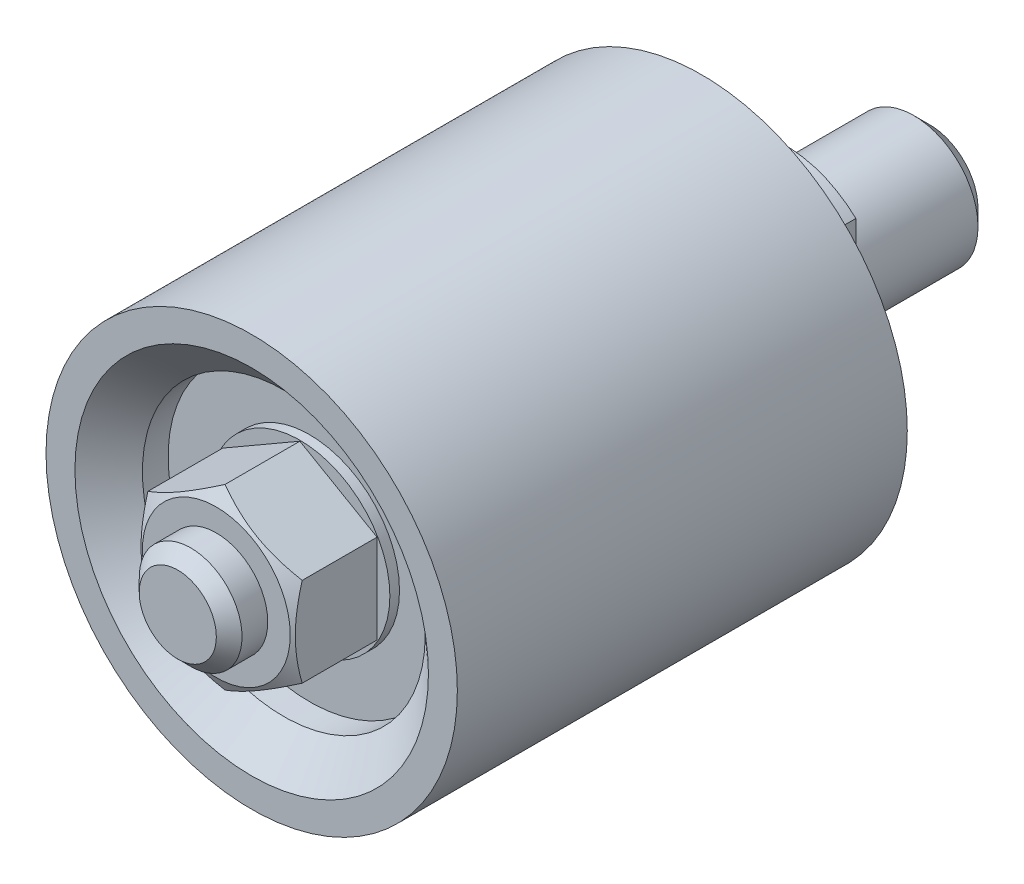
ISO-10303-21;
HEADER;
FILE_DESCRIPTION(('STEP AP214'),'2;1');
FILE_NAME('part.step','',(''),(''),'','','');
FILE_SCHEMA(('AUTOMOTIVE_DESIGN { 1 0 10303 214 1 1 1 1 }'));
ENDSEC;
DATA;
#1=APPLICATION_CONTEXT('core data for automotive mechanical design processes');
#2=APPLICATION_PROTOCOL_DEFINITION('international standard','automotive_design',2000,#1);
#3=PRODUCT_CONTEXT('',#1,'mechanical');
#4=PRODUCT('Part','Part','',(#3));
#5=PRODUCT_RELATED_PRODUCT_CATEGORY('part','',(#4));
#6=PRODUCT_DEFINITION_FORMATION('','',#4);
#7=PRODUCT_DEFINITION_CONTEXT('part definition',#1,'design');
#8=PRODUCT_DEFINITION('design','',#6,#7);
#9=PRODUCT_DEFINITION_SHAPE('','',#8);
#10=(LENGTH_UNIT() NAMED_UNIT(*) SI_UNIT(.MILLI.,.METRE.));
#11=(NAMED_UNIT(*) PLANE_ANGLE_UNIT() SI_UNIT($,.RADIAN.));
#12=(NAMED_UNIT(*) SI_UNIT($,.STERADIAN.) SOLID_ANGLE_UNIT());
#13=UNCERTAINTY_MEASURE_WITH_UNIT(LENGTH_MEASURE(1.E-05),#10,'distance_accuracy_value','');
#14=(GEOMETRIC_REPRESENTATION_CONTEXT(3) GLOBAL_UNCERTAINTY_ASSIGNED_CONTEXT((#13)) GLOBAL_UNIT_ASSIGNED_CONTEXT((#10,
#11,#12)) REPRESENTATION_CONTEXT('',''));
#15=CARTESIAN_POINT('',(0.,0.,0.));
#16=DIRECTION('',(0.,0.,1.));
#17=DIRECTION('',(1.,0.,0.));
#18=AXIS2_PLACEMENT_3D('',#15,#16,#17);
#19=CARTESIAN_POINT('',(0.,-42.5,83.));
#20=DIRECTION('',(0.,0.,1.));
#21=DIRECTION('',(-1.,0.,0.));
#22=AXIS2_PLACEMENT_3D('',#19,#20,#21);
#23=PLANE('',#22);
#24=CARTESIAN_POINT('',(0.,0.,83.));
#25=DIRECTION('',(0.,0.,-1.));
#26=DIRECTION('',(1.,0.,0.));
#27=AXIS2_PLACEMENT_3D('',#24,#25,#26);
#28=CIRCLE('',#27,27.5);
#29=CARTESIAN_POINT('',(27.5,0.,83.));
#30=VERTEX_POINT('',#29);
#31=EDGE_CURVE('E188',#30,#30,#28,.T.);
#32=ORIENTED_EDGE('',*,*,#31,.T.);
#33=EDGE_LOOP('',(#32));
#34=FACE_BOUND('',#33,.T.);
#35=CARTESIAN_POINT('',(0.,0.,83.));
#36=DIRECTION('',(0.,0.,1.));
#37=DIRECTION('',(1.,0.,0.));
#38=AXIS2_PLACEMENT_3D('',#35,#36,#37);
#39=CIRCLE('',#38,32.);
#40=CARTESIAN_POINT('',(32.,0.,83.));
#41=VERTEX_POINT('',#40);
#42=EDGE_CURVE('E635',#41,#41,#39,.T.);
#43=ORIENTED_EDGE('',*,*,#42,.T.);
#44=EDGE_LOOP('',(#43));
#45=FACE_BOUND('',#44,.T.);
#46=ADVANCED_FACE('F15',(#34,#45),#23,.T.);
#47=CARTESIAN_POINT('',(-12.,-6.92820323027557,125.160605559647));
#48=DIRECTION('',(0.5,0.866025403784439,0.));
#49=DIRECTION('',(-0.866025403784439,0.5,0.));
#50=AXIS2_PLACEMENT_3D('',#47,#48,#49);
#51=PLANE('',#50);
#52=CARTESIAN_POINT('',(-12.0002,-6.92808776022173,87.1394614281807));
#53=CARTESIAN_POINT('',(-11.7364142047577,-7.08038456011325,87.2273752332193));
#54=CARTESIAN_POINT('',(-11.4716448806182,-7.23324920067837,87.3112988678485));
#55=CARTESIAN_POINT('',(-10.9399829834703,-7.54020434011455,87.4700586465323));
#56=CARTESIAN_POINT('',(-10.6730897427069,-7.6942952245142,87.5448918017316));
#57=CARTESIAN_POINT('',(-9.868109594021,-8.15905073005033,87.754307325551));
#58=CARTESIAN_POINT('',(-9.32684492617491,-8.4715500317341,87.8734216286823));
#59=CARTESIAN_POINT('',(-8.51686717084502,-8.93919090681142,88.013093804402));
#60=CARTESIAN_POINT('',(-8.25057389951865,-9.09293539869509,88.0528810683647));
#61=CARTESIAN_POINT('',(-7.71675440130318,-9.40113622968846,88.1196014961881));
#62=CARTESIAN_POINT('',(-7.44922815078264,-9.55559258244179,88.1465344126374));
#63=CARTESIAN_POINT('',(-6.91372963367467,-9.86476279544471,88.1868562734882));
#64=CARTESIAN_POINT('',(-6.64575827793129,-10.0194761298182,88.2002613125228));
#65=CARTESIAN_POINT('',(-6.10956726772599,-10.3290461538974,88.213241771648));
#66=CARTESIAN_POINT('',(-5.84134762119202,-10.4839028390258,88.2128176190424));
#67=CARTESIAN_POINT('',(-5.33991062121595,-10.7734076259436,88.1991048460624));
#68=CARTESIAN_POINT('',(-5.10665750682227,-10.908076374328,88.1874888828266));
#69=CARTESIAN_POINT('',(-4.64068775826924,-11.1771041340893,88.1540168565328));
#70=CARTESIAN_POINT('',(-4.40797116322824,-11.3114631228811,88.1321600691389));
#71=CARTESIAN_POINT('',(-3.94320092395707,-11.5797983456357,88.0785874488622));
#72=CARTESIAN_POINT('',(-3.71114798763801,-11.7137741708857,88.0468634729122));
#73=CARTESIAN_POINT('',(-3.24813003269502,-11.9810977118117,87.9741130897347));
#74=CARTESIAN_POINT('',(-3.01716508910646,-12.1144453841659,87.933086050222));
#75=CARTESIAN_POINT('',(-2.31605804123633,-12.5192297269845,87.7950132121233));
#76=CARTESIAN_POINT('',(-1.84794625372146,-12.789494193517,87.6841999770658));
#77=CARTESIAN_POINT('',(-0.918702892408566,-13.3259930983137,87.4326990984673));
#78=CARTESIAN_POINT('',(-0.457559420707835,-13.5922344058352,87.2920705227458));
#79=CARTESIAN_POINT('',(0.000199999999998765,-13.856521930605,87.1394614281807));
#80=B_SPLINE_CURVE_WITH_KNOTS('',3,(#52,#53,#54,#55,#56,#57,#58,#59,#60,#61,#62,#63,#64,#65,#66,
#67,#68,#69,#70,#71,#72,#73,#74,#75,#76,#77,#78,#79),.UNSPECIFIED.,.F.,.F.,(4,2,2,2,2,2,2,2,2,2,
2,2,2,4),(0.,0.951004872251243,1.90232158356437,3.80900466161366,4.73894551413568,
5.66890426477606,6.59775529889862,7.52657763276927,8.33514643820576,9.14377244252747,
9.95306755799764,10.7624176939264,12.4167102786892,14.0677556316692),.UNSPECIFIED.);
#81=CARTESIAN_POINT('',(-12.,-6.92820323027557,87.1395280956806));
#82=VERTEX_POINT('',#81);
#83=CARTESIAN_POINT('',(0.,-13.8564064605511,87.1395280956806));
#84=VERTEX_POINT('',#83);
#85=EDGE_CURVE('E94',#82,#84,#80,.T.);
#86=ORIENTED_EDGE('',*,*,#85,.F.);
#87=DIRECTION('',(0.,0.,-1.));
#88=VECTOR('',#87,1.);
#89=CARTESIAN_POINT('',(-12.,-6.92820323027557,125.160605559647));
#90=LINE('',#89,#88);
#91=CARTESIAN_POINT('',(-12.,-6.92820323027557,75.5));
#92=VERTEX_POINT('',#91);
#93=EDGE_CURVE('E103',#82,#92,#90,.T.);
#94=ORIENTED_EDGE('',*,*,#93,.T.);
#95=DIRECTION('',(0.866025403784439,-0.5,0.));
#96=VECTOR('',#95,1.);
#97=CARTESIAN_POINT('',(-12.,-6.92820323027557,75.5));
#98=LINE('',#97,#96);
#99=CARTESIAN_POINT('',(0.,-13.8564064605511,75.5));
#100=VERTEX_POINT('',#99);
#101=EDGE_CURVE('E111',#92,#100,#98,.T.);
#102=ORIENTED_EDGE('',*,*,#101,.T.);
#103=DIRECTION('',(0.,0.,-1.));
#104=VECTOR('',#103,1.);
#105=CARTESIAN_POINT('',(0.,-13.8564064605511,125.160605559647));
#106=LINE('',#105,#104);
#107=EDGE_CURVE('E104',#84,#100,#106,.T.);
#108=ORIENTED_EDGE('',*,*,#107,.F.);
#109=EDGE_LOOP('',(#86,#94,#102,#108));
#110=FACE_BOUND('',#109,.T.);
#111=ADVANCED_FACE('F101',(#110),#51,.F.);
#112=CARTESIAN_POINT('',(0.,-13.8564064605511,125.160605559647));
#113=DIRECTION('',(-0.5,0.866025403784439,0.));
#114=DIRECTION('',(-0.866025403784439,-0.5,0.));
#115=AXIS2_PLACEMENT_3D('',#112,#113,#114);
#116=PLANE('',#115);
#117=CARTESIAN_POINT('',(-0.000200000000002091,-13.856521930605,87.1394614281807));
#118=CARTESIAN_POINT('',(0.26358579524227,-13.7042251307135,87.2273752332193));
#119=CARTESIAN_POINT('',(0.528355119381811,-13.5513604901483,87.3112988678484));
#120=CARTESIAN_POINT('',(1.06001701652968,-13.2444053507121,87.4700586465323));
#121=CARTESIAN_POINT('',(1.32691025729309,-13.0903144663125,87.5448918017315));
#122=CARTESIAN_POINT('',(2.13189040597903,-12.6255589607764,87.754307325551));
#123=CARTESIAN_POINT('',(2.67315507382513,-12.3130596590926,87.8734216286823));
#124=CARTESIAN_POINT('',(3.48313282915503,-11.8454187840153,88.013093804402));
#125=CARTESIAN_POINT('',(3.74942610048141,-11.6916742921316,88.0528810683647));
#126=CARTESIAN_POINT('',(4.28324559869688,-11.3834734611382,88.119601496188));
#127=CARTESIAN_POINT('',(4.55077184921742,-11.2290171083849,88.1465344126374));
#128=CARTESIAN_POINT('',(5.08627036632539,-10.919846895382,88.1868562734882));
#129=CARTESIAN_POINT('',(5.35424172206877,-10.7651335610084,88.2002613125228));
#130=CARTESIAN_POINT('',(5.89043273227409,-10.4555635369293,88.213241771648));
#131=CARTESIAN_POINT('',(6.15865237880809,-10.300706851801,88.2128176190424));
#132=CARTESIAN_POINT('',(6.66008937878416,-10.0112020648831,88.1991048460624));
#133=CARTESIAN_POINT('',(6.89334249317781,-9.87653331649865,88.1874888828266));
#134=CARTESIAN_POINT('',(7.35931224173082,-9.60750555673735,88.1540168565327));
#135=CARTESIAN_POINT('',(7.59202883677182,-9.47314656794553,88.1321600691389));
#136=CARTESIAN_POINT('',(8.05679907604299,-9.20481134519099,88.0785874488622));
#137=CARTESIAN_POINT('',(8.28885201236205,-9.07083551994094,88.0468634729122));
#138=CARTESIAN_POINT('',(8.75186996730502,-8.80351197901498,87.9741130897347));
#139=CARTESIAN_POINT('',(8.98283491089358,-8.67016430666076,87.9330860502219));
#140=CARTESIAN_POINT('',(9.68394195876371,-8.26537996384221,87.7950132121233));
#141=CARTESIAN_POINT('',(10.1520537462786,-7.99511549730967,87.6841999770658));
#142=CARTESIAN_POINT('',(11.0812971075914,-7.45861659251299,87.4326990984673));
#143=CARTESIAN_POINT('',(11.5424405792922,-7.19237528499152,87.2920705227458));
#144=CARTESIAN_POINT('',(12.0002,-6.92808776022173,87.1394614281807));
#145=B_SPLINE_CURVE_WITH_KNOTS('',3,(#117,#118,#119,#120,#121,#122,#123,#124,#125,#126,#127,
#128,#129,#130,#131,#132,#133,#134,#135,#136,#137,#138,#139,#140,#141,#142,#143,#144),
.UNSPECIFIED.,.F.,.F.,(4,2,2,2,2,2,2,2,2,2,2,2,2,4),(0.,0.951004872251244,1.90232158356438,
3.8090046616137,4.73894551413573,5.66890426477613,6.59775529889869,7.52657763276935,
8.33514643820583,9.14377244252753,9.95306755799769,10.7624176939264,12.4167102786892,
14.0677556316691),.UNSPECIFIED.);
#146=CARTESIAN_POINT('',(12.,-6.92820323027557,87.1395280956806));
#147=VERTEX_POINT('',#146);
#148=EDGE_CURVE('E105',#84,#147,#145,.T.);
#149=ORIENTED_EDGE('',*,*,#148,.F.);
#150=ORIENTED_EDGE('',*,*,#107,.T.);
#151=DIRECTION('',(0.866025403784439,0.5,0.));
#152=VECTOR('',#151,1.);
#153=CARTESIAN_POINT('',(0.,-13.8564064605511,75.5));
#154=LINE('',#153,#152);
#155=CARTESIAN_POINT('',(12.,-6.92820323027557,75.5));
#156=VERTEX_POINT('',#155);
#157=EDGE_CURVE('E427',#100,#156,#154,.T.);
#158=ORIENTED_EDGE('',*,*,#157,.T.);
#159=DIRECTION('',(0.,0.,-1.));
#160=VECTOR('',#159,1.);
#161=CARTESIAN_POINT('',(12.,-6.92820323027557,125.160605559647));
#162=LINE('',#161,#160);
#163=EDGE_CURVE('E425',#147,#156,#162,.T.);
#164=ORIENTED_EDGE('',*,*,#163,.F.);
#165=EDGE_LOOP('',(#149,#150,#158,#164));
#166=FACE_BOUND('',#165,.T.);
#167=ADVANCED_FACE('F228',(#166),#116,.F.);
#168=CARTESIAN_POINT('',(12.,-6.92820323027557,125.160605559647));
#169=DIRECTION('',(-1.,0.,0.));
#170=DIRECTION('',(0.,-1.,0.));
#171=AXIS2_PLACEMENT_3D('',#168,#169,#170);
#172=PLANE('',#171);
#173=CARTESIAN_POINT('',(12.,-18.5111420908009,82.4029353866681));
#174=CARTESIAN_POINT('',(12.,-18.2495002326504,82.5296880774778));
#175=CARTESIAN_POINT('',(12.,-17.9875486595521,82.6558011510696));
#176=CARTESIAN_POINT('',(12.,-17.4629614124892,82.9066029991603));
#177=CARTESIAN_POINT('',(12.,-17.2003257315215,83.0312917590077));
#178=CARTESIAN_POINT('',(12.,-16.4112241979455,83.4030374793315));
#179=CARTESIAN_POINT('',(12.,-15.88364280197,83.6477355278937));
#180=CARTESIAN_POINT('',(12.,-14.8219973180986,84.1306811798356));
#181=CARTESIAN_POINT('',(12.,-14.2879135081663,84.3688855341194));
#182=CARTESIAN_POINT('',(12.,-13.21546367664,84.835416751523));
#183=CARTESIAN_POINT('',(12.,-12.6770978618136,85.063744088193));
#184=CARTESIAN_POINT('',(12.,-11.5782458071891,85.5148760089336));
#185=CARTESIAN_POINT('',(12.,-11.017595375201,85.7372827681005));
#186=CARTESIAN_POINT('',(12.,-9.88969485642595,86.165023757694));
#187=CARTESIAN_POINT('',(12.,-9.3224440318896,86.3703560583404));
#188=CARTESIAN_POINT('',(12.,-8.18155310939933,86.7584822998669));
#189=CARTESIAN_POINT('',(12.,-7.60792895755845,86.941322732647));
#190=CARTESIAN_POINT('',(12.,-6.4523986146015,87.2785428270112));
#191=CARTESIAN_POINT('',(12.,-5.87049512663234,87.4329315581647));
#192=CARTESIAN_POINT('',(12.,-4.99293798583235,87.6371211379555));
#193=CARTESIAN_POINT('',(12.,-4.70042056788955,87.7004860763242));
#194=CARTESIAN_POINT('',(12.,-4.11340579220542,87.8173197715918));
#195=CARTESIAN_POINT('',(12.,-3.81890847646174,87.8707887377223));
#196=CARTESIAN_POINT('',(12.,-3.22814372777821,87.9668808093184));
#197=CARTESIAN_POINT('',(12.,-2.93187631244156,88.0095040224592));
#198=CARTESIAN_POINT('',(12.,-2.33789395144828,88.0830506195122));
#199=CARTESIAN_POINT('',(12.,-2.04017906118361,88.1139744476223));
#200=CARTESIAN_POINT('',(12.,-1.44756141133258,88.1631257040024));
#201=CARTESIAN_POINT('',(12.,-1.15267188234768,88.1815116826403));
#202=CARTESIAN_POINT('',(12.,-0.562380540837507,88.2058034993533));
#203=CARTESIAN_POINT('',(12.,-0.266978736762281,88.2117095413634));
#204=CARTESIAN_POINT('',(12.,0.323811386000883,88.2109013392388));
#205=CARTESIAN_POINT('',(12.,0.619199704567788,88.2041869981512));
#206=CARTESIAN_POINT('',(12.,1.20943354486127,88.1783000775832));
#207=CARTESIAN_POINT('',(12.,1.50427904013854,88.1591269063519));
#208=CARTESIAN_POINT('',(12.,2.21590045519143,88.0982192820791));
#209=CARTESIAN_POINT('',(12.,2.63216502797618,88.0504062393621));
#210=CARTESIAN_POINT('',(12.,3.46154175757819,87.9325751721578));
#211=CARTESIAN_POINT('',(12.,3.87465346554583,87.8625540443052));
#212=CARTESIAN_POINT('',(12.,4.69735211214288,87.702797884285));
#213=CARTESIAN_POINT('',(12.,5.10693598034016,87.6130471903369));
#214=CARTESIAN_POINT('',(12.,5.92196451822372,87.4165647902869));
#215=CARTESIAN_POINT('',(12.,6.32740925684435,87.3098333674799));
#216=CARTESIAN_POINT('',(12.,7.14302753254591,87.0794713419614));
#217=CARTESIAN_POINT('',(12.,7.55311044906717,86.9555220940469));
#218=CARTESIAN_POINT('',(12.,8.36923544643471,86.6950334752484));
#219=CARTESIAN_POINT('',(12.,8.77527750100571,86.5584940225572));
#220=CARTESIAN_POINT('',(12.,9.58352534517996,86.274973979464));
#221=CARTESIAN_POINT('',(12.,9.98573240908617,86.1279970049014));
#222=CARTESIAN_POINT('',(12.,10.7868281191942,85.8253098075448));
#223=CARTESIAN_POINT('',(12.,11.1857168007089,85.6695996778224));
#224=CARTESIAN_POINT('',(12.,12.112392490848,85.2980366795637));
#225=CARTESIAN_POINT('',(12.,12.6390479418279,85.0793662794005));
#226=CARTESIAN_POINT('',(12.,13.6880095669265,84.6318026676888));
#227=CARTESIAN_POINT('',(12.,14.2103154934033,84.4029088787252));
#228=CARTESIAN_POINT('',(12.,15.2513695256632,83.9369063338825));
#229=CARTESIAN_POINT('',(12.,15.7701168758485,83.6997958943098));
#230=CARTESIAN_POINT('',(12.,16.8045284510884,83.2189840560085));
#231=CARTESIAN_POINT('',(12.,17.3201927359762,82.9752827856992));
#232=CARTESIAN_POINT('',(12.,18.3494699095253,82.4822448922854));
#233=CARTESIAN_POINT('',(12.,18.8630801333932,82.2329027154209));
#234=CARTESIAN_POINT('',(12.,19.8881188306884,81.7297744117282));
#235=CARTESIAN_POINT('',(12.,20.3995472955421,81.4759882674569));
#236=CARTESIAN_POINT('',(12.,21.4204911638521,80.9647513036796));
#237=CARTESIAN_POINT('',(12.,21.9300067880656,80.7073009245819));
#238=CARTESIAN_POINT('',(12.,22.947458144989,80.189295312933));
#239=CARTESIAN_POINT('',(12.,23.4553938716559,79.9287400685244));
#240=CARTESIAN_POINT('',(12.,24.8945607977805,79.1857987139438));
#241=CARTESIAN_POINT('',(12.,25.8241883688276,78.7003061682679));
#242=CARTESIAN_POINT('',(12.,27.6799854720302,77.7226987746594));
#243=CARTESIAN_POINT('',(12.,28.6061548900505,77.2305837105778));
#244=CARTESIAN_POINT('',(12.,30.4535876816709,76.2424349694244));
#245=CARTESIAN_POINT('',(12.,31.3748574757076,75.7464132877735));
#246=CARTESIAN_POINT('',(12.,32.7551237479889,74.9994140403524));
#247=CARTESIAN_POINT('',(12.,33.2149276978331,74.7499262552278));
#248=CARTESIAN_POINT('',(12.,34.1340503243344,74.2500600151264));
#249=CARTESIAN_POINT('',(12.,34.5933690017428,73.9996815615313));
#250=CARTESIAN_POINT('',(12.,35.052472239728,73.7489085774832));
#251=B_SPLINE_CURVE_WITH_KNOTS('',3,(#173,#174,#175,#176,#177,#178,#179,#180,#181,#182,#183,
#184,#185,#186,#187,#188,#189,#190,#191,#192,#193,#194,#195,#196,#197,#198,#199,#200,#201,#202,
#203,#204,#205,#206,#207,#208,#209,#210,#211,#212,#213,#214,#215,#216,#217,#218,#219,#220,#221,
#222,#223,#224,#225,#226,#227,#228,#229,#230,#231,#232,#233,#234,#235,#236,#237,#238,#239,#240,
#241,#242,#243,#244,#245,#246,#247,#248,#249,#250),.UNSPECIFIED.,.F.,.F.,(4,2,2,2,2,2,2,2,2,2,2,
2,2,2,2,2,2,2,2,2,2,2,2,2,2,2,2,2,2,2,2,2,2,2,2,2,2,2,4),(0.,0.872182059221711,1.74437308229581,
3.48901842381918,5.2433297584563,6.99755688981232,8.80680391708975,10.6162551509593,
12.4219009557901,14.2269701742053,15.1247351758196,16.0224811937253,16.9202182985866,
17.8179213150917,18.7040505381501,19.5901652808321,20.4762868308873,21.3624504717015,
22.6187576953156,23.8752405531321,25.1327244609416,26.3901873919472,27.6751622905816,
28.9601455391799,30.2446857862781,31.5292123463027,33.2398111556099,34.9505067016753,
36.6615548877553,38.3725697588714,40.0853496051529,41.7981361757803,43.5107185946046,
45.2233075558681,48.3695657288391,51.515926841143,54.6548592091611,56.22424512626,
57.7936286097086),.UNSPECIFIED.);
#252=CARTESIAN_POINT('',(12.,6.92820323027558,87.1395280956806));
#253=VERTEX_POINT('',#252);
#254=EDGE_CURVE('E390',#147,#253,#251,.T.);
#255=ORIENTED_EDGE('',*,*,#254,.F.);
#256=ORIENTED_EDGE('',*,*,#163,.T.);
#257=DIRECTION('',(0.,1.,0.));
#258=VECTOR('',#257,1.);
#259=CARTESIAN_POINT('',(12.,-6.92820323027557,75.5));
#260=LINE('',#259,#258);
#261=CARTESIAN_POINT('',(12.,6.92820323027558,75.5));
#262=VERTEX_POINT('',#261);
#263=EDGE_CURVE('E424',#156,#262,#260,.T.);
#264=ORIENTED_EDGE('',*,*,#263,.T.);
#265=DIRECTION('',(0.,0.,-1.));
#266=VECTOR('',#265,1.);
#267=CARTESIAN_POINT('',(12.,6.92820323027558,125.160605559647));
#268=LINE('',#267,#266);
#269=EDGE_CURVE('E420',#253,#262,#268,.T.);
#270=ORIENTED_EDGE('',*,*,#269,.F.);
#271=EDGE_LOOP('',(#255,#256,#264,#270));
#272=FACE_BOUND('',#271,.T.);
#273=ADVANCED_FACE('F395',(#272),#172,.F.);
#274=CARTESIAN_POINT('',(12.,6.92820323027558,125.160605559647));
#275=DIRECTION('',(-0.5,-0.866025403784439,0.));
#276=DIRECTION('',(0.866025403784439,-0.5,0.));
#277=AXIS2_PLACEMENT_3D('',#274,#275,#276);
#278=PLANE('',#277);
#279=CARTESIAN_POINT('',(12.0002,6.92808776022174,87.1394614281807));
#280=CARTESIAN_POINT('',(11.7364142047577,7.08038456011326,87.2273752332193));
#281=CARTESIAN_POINT('',(11.4716448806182,7.23324920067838,87.3112988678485));
#282=CARTESIAN_POINT('',(10.9399829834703,7.54020434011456,87.4700586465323));
#283=CARTESIAN_POINT('',(10.6730897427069,7.69429522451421,87.5448918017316));
#284=CARTESIAN_POINT('',(9.868109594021,8.15905073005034,87.754307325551));
#285=CARTESIAN_POINT('',(9.32684492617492,8.47155003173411,87.8734216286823));
#286=CARTESIAN_POINT('',(8.51686717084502,8.93919090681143,88.013093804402));
#287=CARTESIAN_POINT('',(8.25057389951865,9.0929353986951,88.0528810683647));
#288=CARTESIAN_POINT('',(7.71675440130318,9.40113622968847,88.1196014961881));
#289=CARTESIAN_POINT('',(7.44922815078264,9.5555925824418,88.1465344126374));
#290=CARTESIAN_POINT('',(6.91372963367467,9.86476279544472,88.1868562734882));
#291=CARTESIAN_POINT('',(6.64575827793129,10.0194761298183,88.2002613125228));
#292=CARTESIAN_POINT('',(6.109567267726,10.3290461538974,88.213241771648));
#293=CARTESIAN_POINT('',(5.84134762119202,10.4839028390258,88.2128176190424));
#294=CARTESIAN_POINT('',(5.33991062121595,10.7734076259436,88.1991048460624));
#295=CARTESIAN_POINT('',(5.10665750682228,10.908076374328,88.1874888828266));
#296=CARTESIAN_POINT('',(4.64068775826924,11.1771041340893,88.1540168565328));
#297=CARTESIAN_POINT('',(4.40797116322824,11.3114631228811,88.1321600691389));
#298=CARTESIAN_POINT('',(3.94320092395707,11.5797983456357,88.0785874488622));
#299=CARTESIAN_POINT('',(3.71114798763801,11.7137741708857,88.0468634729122));
#300=CARTESIAN_POINT('',(3.24813003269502,11.9810977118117,87.9741130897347));
#301=CARTESIAN_POINT('',(3.01716508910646,12.1144453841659,87.9330860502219));
#302=CARTESIAN_POINT('',(2.31605804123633,12.5192297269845,87.7950132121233));
#303=CARTESIAN_POINT('',(1.84794625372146,12.789494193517,87.6841999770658));
#304=CARTESIAN_POINT('',(0.918702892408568,13.3259930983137,87.4326990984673));
#305=CARTESIAN_POINT('',(0.457559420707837,13.5922344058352,87.2920705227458));
#306=CARTESIAN_POINT('',(-0.000199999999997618,13.856521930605,87.1394614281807));
#307=B_SPLINE_CURVE_WITH_KNOTS('',3,(#279,#280,#281,#282,#283,#284,#285,#286,#287,#288,#289,
#290,#291,#292,#293,#294,#295,#296,#297,#298,#299,#300,#301,#302,#303,#304,#305,#306),
.UNSPECIFIED.,.F.,.F.,(4,2,2,2,2,2,2,2,2,2,2,2,2,4),(0.,0.951004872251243,1.90232158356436,
3.80900466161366,4.73894551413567,5.66890426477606,6.59775529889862,7.52657763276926,
8.33514643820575,9.14377244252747,9.95306755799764,10.7624176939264,12.4167102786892,
14.0677556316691),.UNSPECIFIED.);
#308=CARTESIAN_POINT('',(0.,13.8564064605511,87.1395280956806));
#309=VERTEX_POINT('',#308);
#310=EDGE_CURVE('E384',#253,#309,#307,.T.);
#311=ORIENTED_EDGE('',*,*,#310,.F.);
#312=ORIENTED_EDGE('',*,*,#269,.T.);
#313=DIRECTION('',(-0.866025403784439,0.5,0.));
#314=VECTOR('',#313,1.);
#315=CARTESIAN_POINT('',(12.,6.92820323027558,75.5));
#316=LINE('',#315,#314);
#317=CARTESIAN_POINT('',(0.,13.8564064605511,75.5));
#318=VERTEX_POINT('',#317);
#319=EDGE_CURVE('E417',#262,#318,#316,.T.);
#320=ORIENTED_EDGE('',*,*,#319,.T.);
#321=DIRECTION('',(0.,0.,-1.));
#322=VECTOR('',#321,1.);
#323=CARTESIAN_POINT('',(0.,13.8564064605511,125.160605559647));
#324=LINE('',#323,#322);
#325=EDGE_CURVE('E412',#309,#318,#324,.T.);
#326=ORIENTED_EDGE('',*,*,#325,.F.);
#327=EDGE_LOOP('',(#311,#312,#320,#326));
#328=FACE_BOUND('',#327,.T.);
#329=ADVANCED_FACE('F398',(#328),#278,.F.);
#330=CARTESIAN_POINT('',(0.,13.8564064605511,125.160605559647));
#331=DIRECTION('',(0.5,-0.866025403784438,0.));
#332=DIRECTION('',(0.866025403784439,0.5,0.));
#333=AXIS2_PLACEMENT_3D('',#330,#331,#332);
#334=PLANE('',#333);
#335=CARTESIAN_POINT('',(0.0002,13.856521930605,87.1394614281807));
#336=CARTESIAN_POINT('',(-0.263585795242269,13.7042251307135,87.2273752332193));
#337=CARTESIAN_POINT('',(-0.528355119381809,13.5513604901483,87.3112988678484));
#338=CARTESIAN_POINT('',(-1.06001701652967,13.2444053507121,87.4700586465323));
#339=CARTESIAN_POINT('',(-1.32691025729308,13.0903144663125,87.5448918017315));
#340=CARTESIAN_POINT('',(-2.13189040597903,12.6255589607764,87.754307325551));
#341=CARTESIAN_POINT('',(-2.67315507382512,12.3130596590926,87.8734216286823));
#342=CARTESIAN_POINT('',(-3.48313282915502,11.8454187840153,88.013093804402));
#343=CARTESIAN_POINT('',(-3.7494261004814,11.6916742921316,88.0528810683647));
#344=CARTESIAN_POINT('',(-4.28324559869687,11.3834734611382,88.119601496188));
#345=CARTESIAN_POINT('',(-4.55077184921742,11.2290171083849,88.1465344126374));
#346=CARTESIAN_POINT('',(-5.08627036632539,10.919846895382,88.1868562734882));
#347=CARTESIAN_POINT('',(-5.35424172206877,10.7651335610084,88.2002613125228));
#348=CARTESIAN_POINT('',(-5.89043273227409,10.4555635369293,88.213241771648));
#349=CARTESIAN_POINT('',(-6.15865237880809,10.300706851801,88.2128176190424));
#350=CARTESIAN_POINT('',(-6.66008937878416,10.0112020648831,88.1991048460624));
#351=CARTESIAN_POINT('',(-6.8933424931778,9.87653331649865,88.1874888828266));
#352=CARTESIAN_POINT('',(-7.35931224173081,9.60750555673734,88.1540168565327));
#353=CARTESIAN_POINT('',(-7.59202883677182,9.47314656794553,88.1321600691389));
#354=CARTESIAN_POINT('',(-8.05679907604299,9.20481134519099,88.0785874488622));
#355=CARTESIAN_POINT('',(-8.28885201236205,9.07083551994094,88.0468634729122));
#356=CARTESIAN_POINT('',(-8.75186996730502,8.80351197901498,87.9741130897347));
#357=CARTESIAN_POINT('',(-8.98283491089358,8.67016430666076,87.9330860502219));
#358=CARTESIAN_POINT('',(-9.6839419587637,8.2653799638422,87.7950132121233));
#359=CARTESIAN_POINT('',(-10.1520537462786,7.99511549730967,87.6841999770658));
#360=CARTESIAN_POINT('',(-11.0812971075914,7.45861659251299,87.4326990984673));
#361=CARTESIAN_POINT('',(-11.5424405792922,7.19237528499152,87.2920705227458));
#362=CARTESIAN_POINT('',(-12.0002,6.92808776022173,87.1394614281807));
#363=B_SPLINE_CURVE_WITH_KNOTS('',3,(#335,#336,#337,#338,#339,#340,#341,#342,#343,#344,#345,
#346,#347,#348,#349,#350,#351,#352,#353,#354,#355,#356,#357,#358,#359,#360,#361,#362),
.UNSPECIFIED.,.F.,.F.,(4,2,2,2,2,2,2,2,2,2,2,2,2,4),(0.,0.95100487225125,1.90232158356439,
3.80900466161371,4.73894551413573,5.66890426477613,6.5977552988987,7.52657763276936,
8.33514643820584,9.14377244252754,9.9530675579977,10.7624176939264,12.4167102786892,
14.0677556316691),.UNSPECIFIED.);
#364=CARTESIAN_POINT('',(-12.,6.92820323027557,87.1395280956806));
#365=VERTEX_POINT('',#364);
#366=EDGE_CURVE('E31',#309,#365,#363,.T.);
#367=ORIENTED_EDGE('',*,*,#366,.F.);
#368=ORIENTED_EDGE('',*,*,#325,.T.);
#369=DIRECTION('',(-0.866025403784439,-0.5,0.));
#370=VECTOR('',#369,1.);
#371=CARTESIAN_POINT('',(0.,13.8564064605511,75.5));
#372=LINE('',#371,#370);
#373=CARTESIAN_POINT('',(-12.,6.92820323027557,75.5));
#374=VERTEX_POINT('',#373);
#375=EDGE_CURVE('E419',#318,#374,#372,.T.);
#376=ORIENTED_EDGE('',*,*,#375,.T.);
#377=DIRECTION('',(0.,0.,-1.));
#378=VECTOR('',#377,1.);
#379=CARTESIAN_POINT('',(-12.,6.92820323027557,125.160605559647));
#380=LINE('',#379,#378);
#381=EDGE_CURVE('E38',#365,#374,#380,.T.);
#382=ORIENTED_EDGE('',*,*,#381,.F.);
#383=EDGE_LOOP('',(#367,#368,#376,#382));
#384=FACE_BOUND('',#383,.T.);
#385=ADVANCED_FACE('F402',(#384),#334,.F.);
#386=CARTESIAN_POINT('',(-12.,6.92820323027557,125.160605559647));
#387=DIRECTION('',(1.,0.,0.));
#388=DIRECTION('',(0.,0.,-1.));
#389=AXIS2_PLACEMENT_3D('',#386,#387,#388);
#390=PLANE('',#389);
#391=CARTESIAN_POINT('',(-12.,-18.5111420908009,82.4029353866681));
#392=CARTESIAN_POINT('',(-12.,-18.2495002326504,82.5296880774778));
#393=CARTESIAN_POINT('',(-12.,-17.9875486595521,82.6558011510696));
#394=CARTESIAN_POINT('',(-12.,-17.4629614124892,82.9066029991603));
#395=CARTESIAN_POINT('',(-12.,-17.2003257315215,83.0312917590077));
#396=CARTESIAN_POINT('',(-12.,-16.4112241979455,83.4030374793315));
#397=CARTESIAN_POINT('',(-12.,-15.88364280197,83.6477355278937));
#398=CARTESIAN_POINT('',(-12.,-14.8219973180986,84.1306811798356));
#399=CARTESIAN_POINT('',(-12.,-14.2879135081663,84.3688855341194));
#400=CARTESIAN_POINT('',(-12.,-13.2154636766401,84.835416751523));
#401=CARTESIAN_POINT('',(-12.,-12.6770978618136,85.063744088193));
#402=CARTESIAN_POINT('',(-12.,-11.5782458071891,85.5148760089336));
#403=CARTESIAN_POINT('',(-12.,-11.017595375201,85.7372827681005));
#404=CARTESIAN_POINT('',(-12.,-9.88969485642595,86.165023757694));
#405=CARTESIAN_POINT('',(-12.,-9.32244403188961,86.3703560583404));
#406=CARTESIAN_POINT('',(-12.,-8.18155310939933,86.7584822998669));
#407=CARTESIAN_POINT('',(-12.,-7.60792895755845,86.941322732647));
#408=CARTESIAN_POINT('',(-12.,-6.4523986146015,87.2785428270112));
#409=CARTESIAN_POINT('',(-12.,-5.87049512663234,87.4329315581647));
#410=CARTESIAN_POINT('',(-12.,-4.99293798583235,87.6371211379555));
#411=CARTESIAN_POINT('',(-12.,-4.70042056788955,87.7004860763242));
#412=CARTESIAN_POINT('',(-12.,-4.11340579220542,87.8173197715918));
#413=CARTESIAN_POINT('',(-12.,-3.81890847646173,87.8707887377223));
#414=CARTESIAN_POINT('',(-12.,-3.22814372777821,87.9668808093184));
#415=CARTESIAN_POINT('',(-12.,-2.93187631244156,88.0095040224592));
#416=CARTESIAN_POINT('',(-12.,-2.33789395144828,88.0830506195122));
#417=CARTESIAN_POINT('',(-12.,-2.04017906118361,88.1139744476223));
#418=CARTESIAN_POINT('',(-12.,-1.44756141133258,88.1631257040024));
#419=CARTESIAN_POINT('',(-12.,-1.15267188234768,88.1815116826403));
#420=CARTESIAN_POINT('',(-12.,-0.562380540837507,88.2058034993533));
#421=CARTESIAN_POINT('',(-12.,-0.266978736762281,88.2117095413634));
#422=CARTESIAN_POINT('',(-12.,0.323811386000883,88.2109013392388));
#423=CARTESIAN_POINT('',(-12.,0.619199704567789,88.2041869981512));
#424=CARTESIAN_POINT('',(-12.,1.20943354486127,88.1783000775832));
#425=CARTESIAN_POINT('',(-12.,1.50427904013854,88.1591269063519));
#426=CARTESIAN_POINT('',(-12.,2.21590045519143,88.0982192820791));
#427=CARTESIAN_POINT('',(-12.,2.63216502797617,88.0504062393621));
#428=CARTESIAN_POINT('',(-12.,3.46154175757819,87.9325751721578));
#429=CARTESIAN_POINT('',(-12.,3.87465346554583,87.8625540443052));
#430=CARTESIAN_POINT('',(-12.,4.69735211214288,87.702797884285));
#431=CARTESIAN_POINT('',(-12.,5.10693598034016,87.6130471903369));
#432=CARTESIAN_POINT('',(-12.,5.92196451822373,87.4165647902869));
#433=CARTESIAN_POINT('',(-12.,6.32740925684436,87.3098333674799));
#434=CARTESIAN_POINT('',(-12.,7.14302753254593,87.0794713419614));
#435=CARTESIAN_POINT('',(-12.,7.55311044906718,86.9555220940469));
#436=CARTESIAN_POINT('',(-12.,8.36923544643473,86.6950334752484));
#437=CARTESIAN_POINT('',(-12.,8.77527750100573,86.5584940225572));
#438=CARTESIAN_POINT('',(-12.,9.58352534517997,86.274973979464));
#439=CARTESIAN_POINT('',(-12.,9.98573240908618,86.1279970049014));
#440=CARTESIAN_POINT('',(-12.,10.7868281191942,85.8253098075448));
#441=CARTESIAN_POINT('',(-12.,11.1857168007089,85.6695996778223));
#442=CARTESIAN_POINT('',(-12.,12.112392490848,85.2980366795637));
#443=CARTESIAN_POINT('',(-12.,12.6390479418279,85.0793662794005));
#444=CARTESIAN_POINT('',(-12.,13.6880095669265,84.6318026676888));
#445=CARTESIAN_POINT('',(-12.,14.2103154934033,84.4029088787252));
#446=CARTESIAN_POINT('',(-12.,15.2513695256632,83.9369063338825));
#447=CARTESIAN_POINT('',(-12.,15.7701168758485,83.6997958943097));
#448=CARTESIAN_POINT('',(-12.,16.8045284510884,83.2189840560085));
#449=CARTESIAN_POINT('',(-12.,17.3201927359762,82.9752827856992));
#450=CARTESIAN_POINT('',(-12.,18.3494699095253,82.4822448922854));
#451=CARTESIAN_POINT('',(-12.,18.8630801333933,82.2329027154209));
#452=CARTESIAN_POINT('',(-12.,19.8881188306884,81.7297744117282));
#453=CARTESIAN_POINT('',(-12.,20.3995472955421,81.4759882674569));
#454=CARTESIAN_POINT('',(-12.,21.4204911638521,80.9647513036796));
#455=CARTESIAN_POINT('',(-12.,21.9300067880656,80.7073009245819));
#456=CARTESIAN_POINT('',(-12.,22.947458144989,80.189295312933));
#457=CARTESIAN_POINT('',(-12.,23.4553938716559,79.9287400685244));
#458=CARTESIAN_POINT('',(-12.,24.8945607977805,79.1857987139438));
#459=CARTESIAN_POINT('',(-12.,25.8241883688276,78.7003061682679));
#460=CARTESIAN_POINT('',(-12.,27.6799854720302,77.7226987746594));
#461=CARTESIAN_POINT('',(-12.,28.6061548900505,77.2305837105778));
#462=CARTESIAN_POINT('',(-12.,30.4535876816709,76.2424349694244));
#463=CARTESIAN_POINT('',(-12.,31.3748574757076,75.7464132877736));
#464=CARTESIAN_POINT('',(-12.,32.7551237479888,74.9994140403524));
#465=CARTESIAN_POINT('',(-12.,33.2149276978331,74.7499262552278));
#466=CARTESIAN_POINT('',(-12.,34.1340503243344,74.2500600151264));
#467=CARTESIAN_POINT('',(-12.,34.5933690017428,73.9996815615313));
#468=CARTESIAN_POINT('',(-12.,35.052472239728,73.7489085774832));
#469=B_SPLINE_CURVE_WITH_KNOTS('',3,(#391,#392,#393,#394,#395,#396,#397,#398,#399,#400,#401,
#402,#403,#404,#405,#406,#407,#408,#409,#410,#411,#412,#413,#414,#415,#416,#417,#418,#419,#420,
#421,#422,#423,#424,#425,#426,#427,#428,#429,#430,#431,#432,#433,#434,#435,#436,#437,#438,#439,
#440,#441,#442,#443,#444,#445,#446,#447,#448,#449,#450,#451,#452,#453,#454,#455,#456,#457,#458,
#459,#460,#461,#462,#463,#464,#465,#466,#467,#468),.UNSPECIFIED.,.F.,.F.,(4,2,2,2,2,2,2,2,2,2,2,
2,2,2,2,2,2,2,2,2,2,2,2,2,2,2,2,2,2,2,2,2,2,2,2,2,2,2,4),(0.,0.872182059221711,1.74437308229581,
3.48901842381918,5.2433297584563,6.99755688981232,8.80680391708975,10.6162551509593,
12.4219009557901,14.2269701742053,15.1247351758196,16.0224811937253,16.9202182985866,
17.8179213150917,18.7040505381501,19.5901652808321,20.4762868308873,21.3624504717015,
22.6187576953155,23.8752405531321,25.1327244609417,26.3901873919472,27.6751622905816,
28.96014553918,30.2446857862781,31.5292123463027,33.2398111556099,34.9505067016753,
36.6615548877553,38.3725697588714,40.0853496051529,41.7981361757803,43.5107185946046,
45.2233075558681,48.3695657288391,51.515926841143,54.6548592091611,56.22424512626,
57.7936286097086),.UNSPECIFIED.);
#470=EDGE_CURVE('E91',#365,#82,#469,.F.);
#471=ORIENTED_EDGE('',*,*,#470,.F.);
#472=ORIENTED_EDGE('',*,*,#381,.T.);
#473=DIRECTION('',(0.,-1.,0.));
#474=VECTOR('',#473,1.);
#475=CARTESIAN_POINT('',(-12.,6.92820323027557,75.5));
#476=LINE('',#475,#474);
#477=EDGE_CURVE('E109',#374,#92,#476,.T.);
#478=ORIENTED_EDGE('',*,*,#477,.T.);
#479=ORIENTED_EDGE('',*,*,#93,.F.);
#480=EDGE_LOOP('',(#471,#472,#478,#479));
#481=FACE_BOUND('',#480,.T.);
#482=ADVANCED_FACE('F107',(#481),#390,.F.);
#483=CARTESIAN_POINT('',(0.,0.,75.5));
#484=DIRECTION('',(0.,0.,1.));
#485=DIRECTION('',(1.,0.,0.));
#486=AXIS2_PLACEMENT_3D('',#483,#484,#485);
#487=PLANE('',#486);
#488=CARTESIAN_POINT('',(0.,0.,75.5));
#489=DIRECTION('',(0.,0.,1.));
#490=DIRECTION('',(1.,0.,0.));
#491=AXIS2_PLACEMENT_3D('',#488,#489,#490);
#492=CIRCLE('',#491,14.);
#493=CARTESIAN_POINT('',(14.,0.,75.5));
#494=VERTEX_POINT('',#493);
#495=EDGE_CURVE('E133',#494,#494,#492,.T.);
#496=ORIENTED_EDGE('',*,*,#495,.T.);
#497=EDGE_LOOP('',(#496));
#498=FACE_BOUND('',#497,.T.);
#499=ORIENTED_EDGE('',*,*,#157,.F.);
#500=ORIENTED_EDGE('',*,*,#101,.F.);
#501=ORIENTED_EDGE('',*,*,#477,.F.);
#502=ORIENTED_EDGE('',*,*,#375,.F.);
#503=ORIENTED_EDGE('',*,*,#319,.F.);
#504=ORIENTED_EDGE('',*,*,#263,.F.);
#505=EDGE_LOOP('',(#499,#500,#501,#502,#503,#504));
#506=FACE_BOUND('',#505,.T.);
#507=ADVANCED_FACE('F247',(#498,#506),#487,.T.);
#508=CARTESIAN_POINT('',(0.,-10.,74.));
#509=DIRECTION('',(0.,0.,-1.));
#510=DIRECTION('',(1.,0.,0.));
#511=AXIS2_PLACEMENT_3D('',#508,#509,#510);
#512=PLANE('',#511);
#513=CARTESIAN_POINT('',(0.,0.,74.));
#514=DIRECTION('',(0.,0.,-1.));
#515=DIRECTION('',(1.,0.,0.));
#516=AXIS2_PLACEMENT_3D('',#513,#514,#515);
#517=CIRCLE('',#516,22.);
#518=CARTESIAN_POINT('',(22.,0.,74.));
#519=VERTEX_POINT('',#518);
#520=EDGE_CURVE('E144',#519,#519,#517,.T.);
#521=ORIENTED_EDGE('',*,*,#520,.F.);
#522=EDGE_LOOP('',(#521));
#523=FACE_BOUND('',#522,.T.);
#524=CARTESIAN_POINT('',(0.,0.,74.));
#525=DIRECTION('',(0.,0.,1.));
#526=DIRECTION('',(1.,0.,0.));
#527=AXIS2_PLACEMENT_3D('',#524,#525,#526);
#528=CIRCLE('',#527,14.);
#529=CARTESIAN_POINT('',(14.,0.,74.));
#530=VERTEX_POINT('',#529);
#531=EDGE_CURVE('E128',#530,#530,#528,.T.);
#532=ORIENTED_EDGE('',*,*,#531,.F.);
#533=EDGE_LOOP('',(#532));
#534=FACE_BOUND('',#533,.T.);
#535=ADVANCED_FACE('F241',(#523,#534),#512,.F.);
#536=CARTESIAN_POINT('',(0.,0.,28.0000000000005));
#537=DIRECTION('',(0.,0.,-1.));
#538=DIRECTION('',(1.,0.,0.));
#539=AXIS2_PLACEMENT_3D('',#536,#537,#538);
#540=CYLINDRICAL_SURFACE('',#539,22.);
#541=CARTESIAN_POINT('',(0.,0.,78.));
#542=DIRECTION('',(0.,0.,-1.));
#543=DIRECTION('',(1.,0.,0.));
#544=AXIS2_PLACEMENT_3D('',#541,#542,#543);
#545=CIRCLE('',#544,22.);
#546=CARTESIAN_POINT('',(22.,0.,78.));
#547=VERTEX_POINT('',#546);
#548=EDGE_CURVE('E191',#547,#547,#545,.T.);
#549=ORIENTED_EDGE('',*,*,#548,.F.);
#550=EDGE_LOOP('',(#549));
#551=FACE_BOUND('',#550,.T.);
#552=ORIENTED_EDGE('',*,*,#520,.T.);
#553=EDGE_LOOP('',(#552));
#554=FACE_BOUND('',#553,.T.);
#555=ADVANCED_FACE('F239',(#551,#554),#540,.F.);
#556=CARTESIAN_POINT('',(0.,0.,78.));
#557=DIRECTION('',(0.,0.,1.));
#558=DIRECTION('',(-1.,0.,0.));
#559=AXIS2_PLACEMENT_3D('',#556,#557,#558);
#560=CONICAL_SURFACE('',#559,22.,0.832981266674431);
#561=ORIENTED_EDGE('',*,*,#31,.F.);
#562=EDGE_LOOP('',(#561));
#563=FACE_BOUND('',#562,.T.);
#564=ORIENTED_EDGE('',*,*,#548,.T.);
#565=EDGE_LOOP('',(#564));
#566=FACE_BOUND('',#565,.T.);
#567=ADVANCED_FACE('F235',(#563,#566),#560,.F.);
#568=CARTESIAN_POINT('',(0.,0.,75.5));
#569=DIRECTION('',(0.,0.,-1.));
#570=DIRECTION('',(-1.,0.,0.));
#571=AXIS2_PLACEMENT_3D('',#568,#569,#570);
#572=CYLINDRICAL_SURFACE('',#571,14.);
#573=ORIENTED_EDGE('',*,*,#495,.F.);
#574=EDGE_LOOP('',(#573));
#575=FACE_BOUND('',#574,.T.);
#576=ORIENTED_EDGE('',*,*,#531,.T.);
#577=EDGE_LOOP('',(#576));
#578=FACE_BOUND('',#577,.T.);
#579=ADVANCED_FACE('F238',(#575,#578),#572,.T.);
#580=CARTESIAN_POINT('',(0.,0.,88.5));
#581=DIRECTION('',(0.,0.,-1.));
#582=DIRECTION('',(-1.,0.,0.));
#583=AXIS2_PLACEMENT_3D('',#580,#581,#582);
#584=CONICAL_SURFACE('',#583,11.5,1.0471975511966);
#585=CARTESIAN_POINT('',(0.,0.,88.5));
#586=DIRECTION('',(0.,0.,1.));
#587=DIRECTION('',(1.,0.,0.));
#588=AXIS2_PLACEMENT_3D('',#585,#586,#587);
#589=CIRCLE('',#588,11.5);
#590=CARTESIAN_POINT('',(11.5,0.,88.5));
#591=VERTEX_POINT('',#590);
#592=EDGE_CURVE('E97',#591,#591,#589,.T.);
#593=ORIENTED_EDGE('',*,*,#592,.F.);
#594=EDGE_LOOP('',(#593));
#595=FACE_BOUND('',#594,.T.);
#596=ORIENTED_EDGE('',*,*,#85,.T.);
#597=ORIENTED_EDGE('',*,*,#148,.T.);
#598=ORIENTED_EDGE('',*,*,#254,.T.);
#599=ORIENTED_EDGE('',*,*,#310,.T.);
#600=ORIENTED_EDGE('',*,*,#366,.T.);
#601=ORIENTED_EDGE('',*,*,#470,.T.);
#602=EDGE_LOOP('',(#596,#597,#598,#599,#600,#601));
#603=FACE_BOUND('',#602,.T.);
#604=ADVANCED_FACE('F93',(#595,#603),#584,.T.);
#605=CARTESIAN_POINT('',(0.,0.,94.5));
#606=DIRECTION('',(0.,0.,1.));
#607=DIRECTION('',(1.,0.,0.));
#608=AXIS2_PLACEMENT_3D('',#605,#606,#607);
#609=PLANE('',#608);
#610=CARTESIAN_POINT('',(0.,0.,94.5));
#611=DIRECTION('',(0.,0.,1.));
#612=DIRECTION('',(1.,0.,0.));
#613=AXIS2_PLACEMENT_3D('',#610,#611,#612);
#614=CIRCLE('',#613,6.);
#615=CARTESIAN_POINT('',(6.,0.,94.5));
#616=VERTEX_POINT('',#615);
#617=EDGE_CURVE('E24',#616,#616,#614,.T.);
#618=ORIENTED_EDGE('',*,*,#617,.T.);
#619=EDGE_LOOP('',(#618));
#620=FACE_BOUND('',#619,.T.);
#621=ADVANCED_FACE('F204',(#620),#609,.T.);
#622=CARTESIAN_POINT('',(0.,0.,94.5));
#623=DIRECTION('',(0.,0.,-1.));
#624=DIRECTION('',(-1.,0.,0.));
#625=AXIS2_PLACEMENT_3D('',#622,#623,#624);
#626=CONICAL_SURFACE('',#625,6.,0.78539816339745);
#627=CARTESIAN_POINT('',(0.,0.,92.5));
#628=DIRECTION('',(0.,0.,1.));
#629=DIRECTION('',(1.,0.,0.));
#630=AXIS2_PLACEMENT_3D('',#627,#628,#629);
#631=CIRCLE('',#630,8.);
#632=CARTESIAN_POINT('',(8.,0.,92.5));
#633=VERTEX_POINT('',#632);
#634=EDGE_CURVE('E9',#633,#633,#631,.F.);
#635=ORIENTED_EDGE('',*,*,#634,.F.);
#636=EDGE_LOOP('',(#635));
#637=FACE_BOUND('',#636,.T.);
#638=ORIENTED_EDGE('',*,*,#617,.F.);
#639=EDGE_LOOP('',(#638));
#640=FACE_BOUND('',#639,.T.);
#641=ADVANCED_FACE('F17',(#637,#640),#626,.T.);
#642=CARTESIAN_POINT('',(0.,0.,94.5));
#643=DIRECTION('',(0.,0.,-1.));
#644=DIRECTION('',(-1.,0.,0.));
#645=AXIS2_PLACEMENT_3D('',#642,#643,#644);
#646=CYLINDRICAL_SURFACE('',#645,8.);
#647=ORIENTED_EDGE('',*,*,#634,.T.);
#648=EDGE_LOOP('',(#647));
#649=FACE_BOUND('',#648,.T.);
#650=CARTESIAN_POINT('',(0.,0.,88.5));
#651=DIRECTION('',(0.,0.,1.));
#652=DIRECTION('',(1.,0.,0.));
#653=AXIS2_PLACEMENT_3D('',#650,#651,#652);
#654=CIRCLE('',#653,8.);
#655=CARTESIAN_POINT('',(8.,0.,88.5));
#656=VERTEX_POINT('',#655);
#657=EDGE_CURVE('E117',#656,#656,#654,.T.);
#658=ORIENTED_EDGE('',*,*,#657,.T.);
#659=EDGE_LOOP('',(#658));
#660=FACE_BOUND('',#659,.T.);
#661=ADVANCED_FACE('F207',(#649,#660),#646,.T.);
#662=CARTESIAN_POINT('',(-11.9944518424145,20.775,88.5));
#663=DIRECTION('',(0.,0.,1.));
#664=DIRECTION('',(1.,0.,0.));
#665=AXIS2_PLACEMENT_3D('',#662,#663,#664);
#666=PLANE('',#665);
#667=ORIENTED_EDGE('',*,*,#657,.F.);
#668=EDGE_LOOP('',(#667));
#669=FACE_BOUND('',#668,.T.);
#670=ORIENTED_EDGE('',*,*,#592,.T.);
#671=EDGE_LOOP('',(#670));
#672=FACE_BOUND('',#671,.T.);
#673=ADVANCED_FACE('F215',(#669,#672),#666,.T.);
#674=CARTESIAN_POINT('',(0.,0.,-22.5));
#675=DIRECTION('',(0.,0.,1.));
#676=DIRECTION('',(1.,0.,0.));
#677=AXIS2_PLACEMENT_3D('',#674,#675,#676);
#678=CYLINDRICAL_SURFACE('',#677,32.);
#679=ORIENTED_EDGE('',*,*,#42,.F.);
#680=EDGE_LOOP('',(#679));
#681=FACE_BOUND('',#680,.T.);
#682=CARTESIAN_POINT('',(0.,0.,13.0000000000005));
#683=DIRECTION('',(0.,0.,1.));
#684=DIRECTION('',(1.,0.,0.));
#685=AXIS2_PLACEMENT_3D('',#682,#683,#684);
#686=CIRCLE('',#685,32.);
#687=CARTESIAN_POINT('',(32.,0.,13.0000000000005));
#688=VERTEX_POINT('',#687);
#689=EDGE_CURVE('E19',#688,#688,#686,.T.);
#690=ORIENTED_EDGE('',*,*,#689,.T.);
#691=EDGE_LOOP('',(#690));
#692=FACE_BOUND('',#691,.T.);
#693=ADVANCED_FACE('F273',(#681,#692),#678,.T.);
#694=CARTESIAN_POINT('',(0.,0.,-22.5));
#695=DIRECTION('',(0.,0.,1.));
#696=DIRECTION('',(1.,0.,0.));
#697=AXIS2_PLACEMENT_3D('',#694,#695,#696);
#698=PLANE('',#697);
#699=CARTESIAN_POINT('',(0.,0.,-22.5));
#700=DIRECTION('',(0.,0.,1.));
#701=DIRECTION('',(1.,0.,0.));
#702=AXIS2_PLACEMENT_3D('',#699,#700,#701);
#703=CIRCLE('',#702,7.5);
#704=CARTESIAN_POINT('',(7.5,0.,-22.5));
#705=VERTEX_POINT('',#704);
#706=EDGE_CURVE('E198',#705,#705,#703,.F.);
#707=ORIENTED_EDGE('',*,*,#706,.T.);
#708=EDGE_LOOP('',(#707));
#709=FACE_BOUND('',#708,.T.);
#710=ADVANCED_FACE('F263',(#709),#698,.F.);
#711=CARTESIAN_POINT('',(0.,0.,-20.));
#712=DIRECTION('',(0.,0.,1.));
#713=DIRECTION('',(1.,0.,0.));
#714=AXIS2_PLACEMENT_3D('',#711,#712,#713);
#715=CONICAL_SURFACE('',#714,10.,0.785398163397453);
#716=ORIENTED_EDGE('',*,*,#706,.F.);
#717=EDGE_LOOP('',(#716));
#718=FACE_BOUND('',#717,.T.);
#719=CARTESIAN_POINT('',(0.,0.,-20.));
#720=DIRECTION('',(0.,0.,1.));
#721=DIRECTION('',(1.,0.,0.));
#722=AXIS2_PLACEMENT_3D('',#719,#720,#721);
#723=CIRCLE('',#722,10.);
#724=CARTESIAN_POINT('',(10.,0.,-20.));
#725=VERTEX_POINT('',#724);
#726=EDGE_CURVE('E139',#725,#725,#723,.T.);
#727=ORIENTED_EDGE('',*,*,#726,.F.);
#728=EDGE_LOOP('',(#727));
#729=FACE_BOUND('',#728,.T.);
#730=ADVANCED_FACE('F260',(#718,#729),#715,.T.);
#731=CARTESIAN_POINT('',(0.,0.,0.));
#732=DIRECTION('',(0.,0.,-1.));
#733=DIRECTION('',(-1.,0.,0.));
#734=AXIS2_PLACEMENT_3D('',#731,#732,#733);
#735=CYLINDRICAL_SURFACE('',#734,10.);
#736=ORIENTED_EDGE('',*,*,#726,.T.);
#737=EDGE_LOOP('',(#736));
#738=FACE_BOUND('',#737,.T.);
#739=CARTESIAN_POINT('',(0.,0.,0.));
#740=DIRECTION('',(0.,0.,1.));
#741=DIRECTION('',(1.,0.,0.));
#742=AXIS2_PLACEMENT_3D('',#739,#740,#741);
#743=CIRCLE('',#742,10.);
#744=CARTESIAN_POINT('',(10.,0.,0.));
#745=VERTEX_POINT('',#744);
#746=EDGE_CURVE('E166',#745,#745,#743,.T.);
#747=ORIENTED_EDGE('',*,*,#746,.F.);
#748=EDGE_LOOP('',(#747));
#749=FACE_BOUND('',#748,.T.);
#750=ADVANCED_FACE('F262',(#738,#749),#735,.T.);
#751=CARTESIAN_POINT('',(0.,0.,0.));
#752=DIRECTION('',(0.,0.,1.));
#753=DIRECTION('',(1.,0.,0.));
#754=AXIS2_PLACEMENT_3D('',#751,#752,#753);
#755=PLANE('',#754);
#756=ORIENTED_EDGE('',*,*,#746,.T.);
#757=EDGE_LOOP('',(#756));
#758=FACE_BOUND('',#757,.T.);
#759=DIRECTION('',(0.,-1.,0.));
#760=VECTOR('',#759,1.);
#761=CARTESIAN_POINT('',(-11.,0.,0.));
#762=LINE('',#761,#760);
#763=CARTESIAN_POINT('',(-11.,11.6189500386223,0.));
#764=VERTEX_POINT('',#763);
#765=CARTESIAN_POINT('',(-11.,-11.6189500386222,0.));
#766=VERTEX_POINT('',#765);
#767=EDGE_CURVE('E150',#764,#766,#762,.T.);
#768=ORIENTED_EDGE('',*,*,#767,.F.);
#769=CARTESIAN_POINT('',(0.,0.,0.));
#770=DIRECTION('',(0.,0.,1.));
#771=DIRECTION('',(1.,0.,0.));
#772=AXIS2_PLACEMENT_3D('',#769,#770,#771);
#773=CIRCLE('',#772,16.);
#774=CARTESIAN_POINT('',(11.,11.6189500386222,0.));
#775=VERTEX_POINT('',#774);
#776=EDGE_CURVE('E170',#775,#764,#773,.T.);
#777=ORIENTED_EDGE('',*,*,#776,.F.);
#778=DIRECTION('',(0.,-1.,0.));
#779=VECTOR('',#778,1.);
#780=CARTESIAN_POINT('',(11.,0.,0.));
#781=LINE('',#780,#779);
#782=CARTESIAN_POINT('',(11.,-11.6189500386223,0.));
#783=VERTEX_POINT('',#782);
#784=EDGE_CURVE('E160',#775,#783,#781,.T.);
#785=ORIENTED_EDGE('',*,*,#784,.T.);
#786=EDGE_CURVE('E169',#766,#783,#773,.T.);
#787=ORIENTED_EDGE('',*,*,#786,.F.);
#788=EDGE_LOOP('',(#768,#777,#785,#787));
#789=FACE_BOUND('',#788,.T.);
#790=ADVANCED_FACE('F270',(#758,#789),#755,.F.);
#791=CARTESIAN_POINT('',(0.,0.,22.));
#792=DIRECTION('',(0.,0.,-1.));
#793=DIRECTION('',(-1.,0.,0.));
#794=AXIS2_PLACEMENT_3D('',#791,#792,#793);
#795=CYLINDRICAL_SURFACE('',#794,16.);
#796=DIRECTION('',(0.,0.,1.));
#797=VECTOR('',#796,1.);
#798=CARTESIAN_POINT('',(-11.,-11.6189500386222,-22.5));
#799=LINE('',#798,#797);
#800=CARTESIAN_POINT('',(-11.,-11.6189500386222,22.));
#801=VERTEX_POINT('',#800);
#802=EDGE_CURVE('E143',#766,#801,#799,.T.);
#803=ORIENTED_EDGE('',*,*,#802,.F.);
#804=ORIENTED_EDGE('',*,*,#786,.T.);
#805=DIRECTION('',(0.,0.,1.));
#806=VECTOR('',#805,1.);
#807=CARTESIAN_POINT('',(11.,-11.6189500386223,-22.5));
#808=LINE('',#807,#806);
#809=CARTESIAN_POINT('',(11.,-11.6189500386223,22.));
#810=VERTEX_POINT('',#809);
#811=EDGE_CURVE('E157',#783,#810,#808,.T.);
#812=ORIENTED_EDGE('',*,*,#811,.T.);
#813=CARTESIAN_POINT('',(0.,0.,22.));
#814=DIRECTION('',(0.,0.,1.));
#815=DIRECTION('',(1.,0.,0.));
#816=AXIS2_PLACEMENT_3D('',#813,#814,#815);
#817=CIRCLE('',#816,16.);
#818=EDGE_CURVE('E173',#801,#810,#817,.T.);
#819=ORIENTED_EDGE('',*,*,#818,.F.);
#820=EDGE_LOOP('',(#803,#804,#812,#819));
#821=FACE_BOUND('',#820,.T.);
#822=ADVANCED_FACE('F284',(#821),#795,.T.);
#823=CARTESIAN_POINT('',(-11.,11.6189500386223,-22.5));
#824=DIRECTION('',(-1.,0.,0.));
#825=DIRECTION('',(0.,-1.,0.));
#826=AXIS2_PLACEMENT_3D('',#823,#824,#825);
#827=PLANE('',#826);
#828=ORIENTED_EDGE('',*,*,#767,.T.);
#829=ORIENTED_EDGE('',*,*,#802,.T.);
#830=DIRECTION('',(0.,-1.,0.));
#831=VECTOR('',#830,1.);
#832=CARTESIAN_POINT('',(-11.,11.6189500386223,22.));
#833=LINE('',#832,#831);
#834=CARTESIAN_POINT('',(-11.,11.6189500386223,22.));
#835=VERTEX_POINT('',#834);
#836=EDGE_CURVE('E140',#835,#801,#833,.T.);
#837=ORIENTED_EDGE('',*,*,#836,.F.);
#838=DIRECTION('',(0.,0.,1.));
#839=VECTOR('',#838,1.);
#840=CARTESIAN_POINT('',(-11.,11.6189500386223,-22.5));
#841=LINE('',#840,#839);
#842=EDGE_CURVE('E147',#764,#835,#841,.T.);
#843=ORIENTED_EDGE('',*,*,#842,.F.);
#844=EDGE_LOOP('',(#828,#829,#837,#843));
#845=FACE_BOUND('',#844,.T.);
#846=ADVANCED_FACE('F299',(#845),#827,.T.);
#847=ORIENTED_EDGE('',*,*,#842,.T.);
#848=CARTESIAN_POINT('',(11.,11.6189500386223,22.));
#849=VERTEX_POINT('',#848);
#850=EDGE_CURVE('E174',#849,#835,#817,.T.);
#851=ORIENTED_EDGE('',*,*,#850,.F.);
#852=DIRECTION('',(0.,0.,1.));
#853=VECTOR('',#852,1.);
#854=CARTESIAN_POINT('',(11.,11.6189500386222,-22.5));
#855=LINE('',#854,#853);
#856=EDGE_CURVE('E154',#775,#849,#855,.T.);
#857=ORIENTED_EDGE('',*,*,#856,.F.);
#858=ORIENTED_EDGE('',*,*,#776,.T.);
#859=EDGE_LOOP('',(#847,#851,#857,#858));
#860=FACE_BOUND('',#859,.T.);
#861=ADVANCED_FACE('F293',(#860),#795,.T.);
#862=CARTESIAN_POINT('',(11.,11.6189500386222,-22.5));
#863=DIRECTION('',(-1.,0.,0.));
#864=DIRECTION('',(0.,0.,1.));
#865=AXIS2_PLACEMENT_3D('',#862,#863,#864);
#866=PLANE('',#865);
#867=ORIENTED_EDGE('',*,*,#856,.T.);
#868=DIRECTION('',(0.,-1.,0.));
#869=VECTOR('',#868,1.);
#870=CARTESIAN_POINT('',(11.,11.6189500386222,22.));
#871=LINE('',#870,#869);
#872=EDGE_CURVE('E152',#849,#810,#871,.T.);
#873=ORIENTED_EDGE('',*,*,#872,.T.);
#874=ORIENTED_EDGE('',*,*,#811,.F.);
#875=ORIENTED_EDGE('',*,*,#784,.F.);
#876=EDGE_LOOP('',(#867,#873,#874,#875));
#877=FACE_BOUND('',#876,.T.);
#878=ADVANCED_FACE('F258',(#877),#866,.F.);
#879=CARTESIAN_POINT('',(0.,-10.,22.0000000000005));
#880=DIRECTION('',(0.,0.,-1.));
#881=DIRECTION('',(1.,0.,0.));
#882=AXIS2_PLACEMENT_3D('',#879,#880,#881);
#883=PLANE('',#882);
#884=ORIENTED_EDGE('',*,*,#872,.F.);
#885=ORIENTED_EDGE('',*,*,#850,.T.);
#886=ORIENTED_EDGE('',*,*,#836,.T.);
#887=ORIENTED_EDGE('',*,*,#818,.T.);
#888=EDGE_LOOP('',(#884,#885,#886,#887));
#889=FACE_BOUND('',#888,.T.);
#890=CARTESIAN_POINT('',(0.,0.,22.0000000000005));
#891=DIRECTION('',(0.,0.,-1.));
#892=DIRECTION('',(1.,0.,0.));
#893=AXIS2_PLACEMENT_3D('',#890,#891,#892);
#894=CIRCLE('',#893,22.);
#895=CARTESIAN_POINT('',(22.,0.,22.0000000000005));
#896=VERTEX_POINT('',#895);
#897=EDGE_CURVE('E179',#896,#896,#894,.T.);
#898=ORIENTED_EDGE('',*,*,#897,.T.);
#899=EDGE_LOOP('',(#898));
#900=FACE_BOUND('',#899,.T.);
#901=ADVANCED_FACE('F255',(#889,#900),#883,.T.);
#902=CARTESIAN_POINT('',(0.,0.,28.0000000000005));
#903=DIRECTION('',(0.,0.,-1.));
#904=DIRECTION('',(1.,0.,0.));
#905=AXIS2_PLACEMENT_3D('',#902,#903,#904);
#906=CYLINDRICAL_SURFACE('',#905,22.);
#907=CARTESIAN_POINT('',(0.,0.,18.0000000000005));
#908=DIRECTION('',(0.,0.,-1.));
#909=DIRECTION('',(1.,0.,0.));
#910=AXIS2_PLACEMENT_3D('',#907,#908,#909);
#911=CIRCLE('',#910,22.);
#912=CARTESIAN_POINT('',(22.,0.,18.0000000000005));
#913=VERTEX_POINT('',#912);
#914=EDGE_CURVE('E182',#913,#913,#911,.T.);
#915=ORIENTED_EDGE('',*,*,#914,.T.);
#916=EDGE_LOOP('',(#915));
#917=FACE_BOUND('',#916,.T.);
#918=ORIENTED_EDGE('',*,*,#897,.F.);
#919=EDGE_LOOP('',(#918));
#920=FACE_BOUND('',#919,.T.);
#921=ADVANCED_FACE('F257',(#917,#920),#906,.F.);
#922=CARTESIAN_POINT('',(0.,0.,18.0000000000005));
#923=DIRECTION('',(0.,0.,-1.));
#924=DIRECTION('',(1.,0.,0.));
#925=AXIS2_PLACEMENT_3D('',#922,#923,#924);
#926=CONICAL_SURFACE('',#925,22.,0.832981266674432);
#927=CARTESIAN_POINT('',(0.,0.,13.0000000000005));
#928=DIRECTION('',(0.,0.,-1.));
#929=DIRECTION('',(1.,0.,0.));
#930=AXIS2_PLACEMENT_3D('',#927,#928,#929);
#931=CIRCLE('',#930,27.5);
#932=CARTESIAN_POINT('',(27.5,0.,13.0000000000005));
#933=VERTEX_POINT('',#932);
#934=EDGE_CURVE('E185',#933,#933,#931,.T.);
#935=ORIENTED_EDGE('',*,*,#934,.T.);
#936=EDGE_LOOP('',(#935));
#937=FACE_BOUND('',#936,.T.);
#938=ORIENTED_EDGE('',*,*,#914,.F.);
#939=EDGE_LOOP('',(#938));
#940=FACE_BOUND('',#939,.T.);
#941=ADVANCED_FACE('F304',(#937,#940),#926,.F.);
#942=CARTESIAN_POINT('',(0.,-42.5,13.0000000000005));
#943=DIRECTION('',(0.,0.,1.));
#944=DIRECTION('',(-1.,0.,0.));
#945=AXIS2_PLACEMENT_3D('',#942,#943,#944);
#946=PLANE('',#945);
#947=ORIENTED_EDGE('',*,*,#934,.F.);
#948=EDGE_LOOP('',(#947));
#949=FACE_BOUND('',#948,.T.);
#950=ORIENTED_EDGE('',*,*,#689,.F.);
#951=EDGE_LOOP('',(#950));
#952=FACE_BOUND('',#951,.T.);
#953=ADVANCED_FACE('F233',(#949,#952),#946,.F.);
#954=CLOSED_SHELL('',(#46,#111,#167,#273,#329,#385,#482,#507,#535,#555,#567,#579,#604,#621,#641,
#661,#673,#693,#710,#730,#750,#790,#822,#846,#861,#878,#901,#921,#941,#953));
#955=CARTESIAN_POINT('',(0.,0.,75.5));
#956=DIRECTION('',(0.,0.,-1.));
#957=DIRECTION('',(-1.,0.,0.));
#958=AXIS2_PLACEMENT_3D('',#955,#956,#957);
#959=CYLINDRICAL_SURFACE('',#958,8.1);
#960=CARTESIAN_POINT('',(0.,0.,75.5));
#961=DIRECTION('',(0.,0.,1.));
#962=DIRECTION('',(1.,0.,0.));
#963=AXIS2_PLACEMENT_3D('',#960,#961,#962);
#964=CIRCLE('',#963,8.1);
#965=CARTESIAN_POINT('',(8.1,0.,75.5));
#966=VERTEX_POINT('',#965);
#967=EDGE_CURVE('E124',#966,#966,#964,.T.);
#968=ORIENTED_EDGE('',*,*,#967,.T.);
#969=EDGE_LOOP('',(#968));
#970=FACE_BOUND('',#969,.T.);
#971=CARTESIAN_POINT('',(0.,0.,74.));
#972=DIRECTION('',(0.,0.,1.));
#973=DIRECTION('',(1.,0.,0.));
#974=AXIS2_PLACEMENT_3D('',#971,#972,#973);
#975=CIRCLE('',#974,8.1);
#976=CARTESIAN_POINT('',(8.1,0.,74.));
#977=VERTEX_POINT('',#976);
#978=EDGE_CURVE('E125',#977,#977,#975,.T.);
#979=ORIENTED_EDGE('',*,*,#978,.F.);
#980=EDGE_LOOP('',(#979));
#981=FACE_BOUND('',#980,.T.);
#982=ADVANCED_FACE('F335',(#970,#981),#959,.F.);
#983=CARTESIAN_POINT('',(-11.9944518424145,20.775,75.5));
#984=DIRECTION('',(0.,0.,1.));
#985=DIRECTION('',(1.,0.,0.));
#986=AXIS2_PLACEMENT_3D('',#983,#984,#985);
#987=PLANE('',#986);
#988=CARTESIAN_POINT('',(0.,0.,75.5));
#989=DIRECTION('',(0.,0.,1.));
#990=DIRECTION('',(1.,0.,0.));
#991=AXIS2_PLACEMENT_3D('',#988,#989,#990);
#992=CIRCLE('',#991,8.);
#993=CARTESIAN_POINT('',(8.,0.,75.5));
#994=VERTEX_POINT('',#993);
#995=EDGE_CURVE('E120',#994,#994,#992,.T.);
#996=ORIENTED_EDGE('',*,*,#995,.T.);
#997=EDGE_LOOP('',(#996));
#998=FACE_BOUND('',#997,.T.);
#999=ORIENTED_EDGE('',*,*,#967,.F.);
#1000=EDGE_LOOP('',(#999));
#1001=FACE_BOUND('',#1000,.T.);
#1002=ADVANCED_FACE('F333',(#998,#1001),#987,.F.);
#1003=CARTESIAN_POINT('',(0.,0.,74.));
#1004=DIRECTION('',(0.,0.,1.));
#1005=DIRECTION('',(1.,0.,0.));
#1006=AXIS2_PLACEMENT_3D('',#1003,#1004,#1005);
#1007=PLANE('',#1006);
#1008=CARTESIAN_POINT('',(0.,0.,74.));
#1009=DIRECTION('',(0.,0.,1.));
#1010=DIRECTION('',(1.,0.,0.));
#1011=AXIS2_PLACEMENT_3D('',#1008,#1009,#1010);
#1012=CIRCLE('',#1011,10.);
#1013=CARTESIAN_POINT('',(9.99999999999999,0.,74.));
#1014=VERTEX_POINT('',#1013);
#1015=EDGE_CURVE('E136',#1014,#1014,#1012,.F.);
#1016=ORIENTED_EDGE('',*,*,#1015,.T.);
#1017=EDGE_LOOP('',(#1016));
#1018=FACE_BOUND('',#1017,.T.);
#1019=ORIENTED_EDGE('',*,*,#978,.T.);
#1020=EDGE_LOOP('',(#1019));
#1021=FACE_BOUND('',#1020,.T.);
#1022=ADVANCED_FACE('F253',(#1018,#1021),#1007,.F.);
#1023=CARTESIAN_POINT('',(0.,0.,72.5));
#1024=DIRECTION('',(0.,0.,1.));
#1025=DIRECTION('',(1.,0.,0.));
#1026=AXIS2_PLACEMENT_3D('',#1023,#1024,#1025);
#1027=PLANE('',#1026);
#1028=CARTESIAN_POINT('',(0.,0.,72.5));
#1029=DIRECTION('',(0.,0.,1.));
#1030=DIRECTION('',(1.,0.,0.));
#1031=AXIS2_PLACEMENT_3D('',#1028,#1029,#1030);
#1032=CIRCLE('',#1031,8.);
#1033=CARTESIAN_POINT('',(8.,0.,72.5));
#1034=VERTEX_POINT('',#1033);
#1035=EDGE_CURVE('E121',#1034,#1034,#1032,.T.);
#1036=ORIENTED_EDGE('',*,*,#1035,.F.);
#1037=EDGE_LOOP('',(#1036));
#1038=FACE_BOUND('',#1037,.T.);
#1039=CARTESIAN_POINT('',(0.,0.,72.5));
#1040=DIRECTION('',(0.,0.,1.));
#1041=DIRECTION('',(1.,0.,0.));
#1042=AXIS2_PLACEMENT_3D('',#1039,#1040,#1041);
#1043=CIRCLE('',#1042,10.);
#1044=CARTESIAN_POINT('',(10.,0.,72.5));
#1045=VERTEX_POINT('',#1044);
#1046=EDGE_CURVE('E163',#1045,#1045,#1043,.T.);
#1047=ORIENTED_EDGE('',*,*,#1046,.T.);
#1048=EDGE_LOOP('',(#1047));
#1049=FACE_BOUND('',#1048,.T.);
#1050=ADVANCED_FACE('F315',(#1038,#1049),#1027,.T.);
#1051=ORIENTED_EDGE('',*,*,#995,.F.);
#1052=EDGE_LOOP('',(#1051));
#1053=FACE_BOUND('',#1052,.T.);
#1054=ORIENTED_EDGE('',*,*,#1035,.T.);
#1055=EDGE_LOOP('',(#1054));
#1056=FACE_BOUND('',#1055,.T.);
#1057=ADVANCED_FACE('F218',(#1053,#1056),#646,.T.);
#1058=CARTESIAN_POINT('',(0.,0.,28.0000000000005));
#1059=DIRECTION('',(0.,0.,-1.));
#1060=DIRECTION('',(1.,0.,0.));
#1061=AXIS2_PLACEMENT_3D('',#1058,#1059,#1060);
#1062=CYLINDRICAL_SURFACE('',#1061,10.);
#1063=ORIENTED_EDGE('',*,*,#1046,.F.);
#1064=EDGE_LOOP('',(#1063));
#1065=FACE_BOUND('',#1064,.T.);
#1066=ORIENTED_EDGE('',*,*,#1015,.F.);
#1067=EDGE_LOOP('',(#1066));
#1068=FACE_BOUND('',#1067,.T.);
#1069=ADVANCED_FACE('F249',(#1065,#1068),#1062,.F.);
#1070=CLOSED_SHELL('',(#982,#1002,#1022,#1050,#1057,#1069));
#1071=ORIENTED_CLOSED_SHELL('',*,#1070,.T.);
#1072=BREP_WITH_VOIDS('B1',#954,(#1071));
#1073=ADVANCED_BREP_SHAPE_REPRESENTATION('',(#18,#1072),#14);
#1074=SHAPE_DEFINITION_REPRESENTATION(#9,#1073);
ENDSEC;
END-ISO-10303-21;
